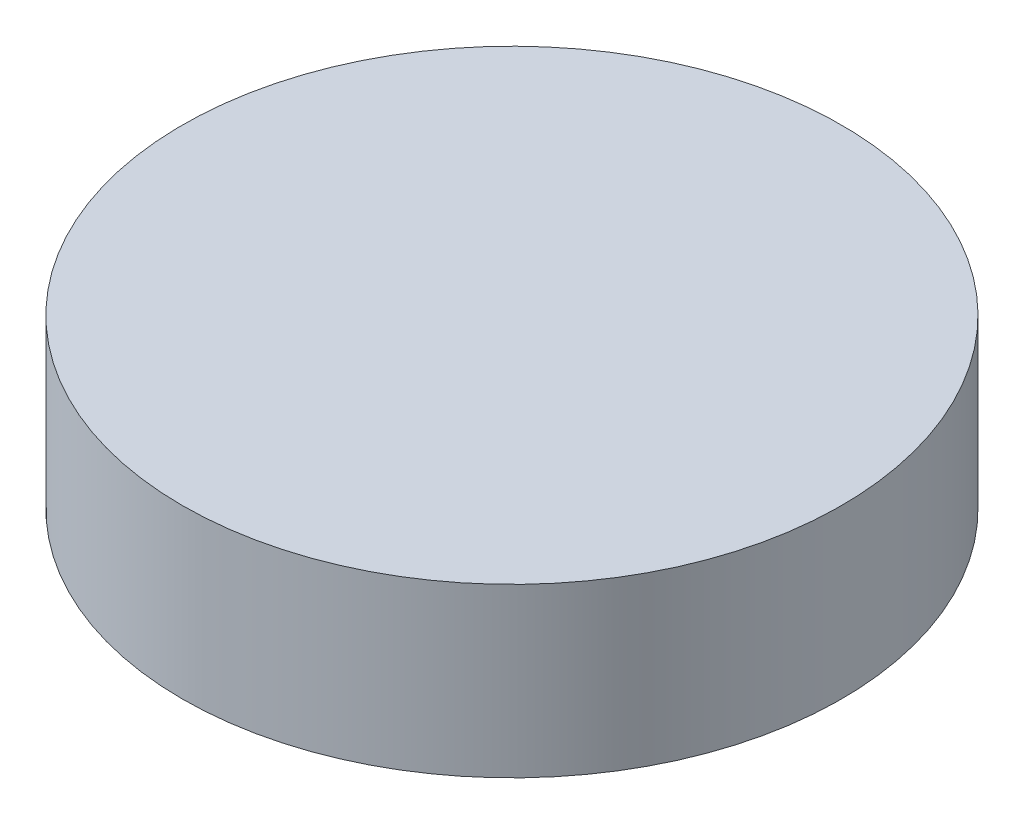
ISO-10303-21;
HEADER;
FILE_DESCRIPTION(('STEP AP214'),'2;1');
FILE_NAME('part.step','',(''),(''),'','','');
FILE_SCHEMA(('AUTOMOTIVE_DESIGN { 1 0 10303 214 1 1 1 1 }'));
ENDSEC;
DATA;
#1=APPLICATION_CONTEXT('core data for automotive mechanical design processes');
#2=APPLICATION_PROTOCOL_DEFINITION('international standard','automotive_design',2000,#1);
#3=PRODUCT_CONTEXT('',#1,'mechanical');
#4=PRODUCT('Part','Part','',(#3));
#5=PRODUCT_RELATED_PRODUCT_CATEGORY('part','',(#4));
#6=PRODUCT_DEFINITION_FORMATION('','',#4);
#7=PRODUCT_DEFINITION_CONTEXT('part definition',#1,'design');
#8=PRODUCT_DEFINITION('design','',#6,#7);
#9=PRODUCT_DEFINITION_SHAPE('','',#8);
#10=(LENGTH_UNIT() NAMED_UNIT(*) SI_UNIT(.MILLI.,.METRE.));
#11=(NAMED_UNIT(*) PLANE_ANGLE_UNIT() SI_UNIT($,.RADIAN.));
#12=(NAMED_UNIT(*) SI_UNIT($,.STERADIAN.) SOLID_ANGLE_UNIT());
#13=UNCERTAINTY_MEASURE_WITH_UNIT(LENGTH_MEASURE(1.E-05),#10,'distance_accuracy_value','');
#14=(GEOMETRIC_REPRESENTATION_CONTEXT(3) GLOBAL_UNCERTAINTY_ASSIGNED_CONTEXT((#13)) GLOBAL_UNIT_ASSIGNED_CONTEXT((#10,
#11,#12)) REPRESENTATION_CONTEXT('',''));
#15=CARTESIAN_POINT('',(0.,0.,0.));
#16=DIRECTION('',(0.,0.,1.));
#17=DIRECTION('',(1.,0.,0.));
#18=AXIS2_PLACEMENT_3D('',#15,#16,#17);
#19=CARTESIAN_POINT('',(0.,15.,0.));
#20=DIRECTION('',(0.,-1.,0.));
#21=DIRECTION('',(0.,0.,-1.));
#22=AXIS2_PLACEMENT_3D('',#19,#20,#21);
#23=CYLINDRICAL_SURFACE('',#22,29.5);
#24=CARTESIAN_POINT('',(0.,15.,0.));
#25=DIRECTION('',(0.,1.,0.));
#26=DIRECTION('',(0.,0.,1.));
#27=AXIS2_PLACEMENT_3D('',#24,#25,#26);
#28=CIRCLE('',#27,29.5);
#29=CARTESIAN_POINT('',(0.,15.,29.5));
#30=VERTEX_POINT('',#29);
#31=EDGE_CURVE('E10',#30,#30,#28,.T.);
#32=ORIENTED_EDGE('',*,*,#31,.F.);
#33=EDGE_LOOP('',(#32));
#34=FACE_BOUND('',#33,.T.);
#35=CARTESIAN_POINT('',(0.,0.,0.));
#36=DIRECTION('',(0.,1.,0.));
#37=DIRECTION('',(0.,0.,1.));
#38=AXIS2_PLACEMENT_3D('',#35,#36,#37);
#39=CIRCLE('',#38,29.5);
#40=CARTESIAN_POINT('',(0.,0.,29.5));
#41=VERTEX_POINT('',#40);
#42=EDGE_CURVE('E34',#41,#41,#39,.T.);
#43=ORIENTED_EDGE('',*,*,#42,.T.);
#44=EDGE_LOOP('',(#43));
#45=FACE_BOUND('',#44,.T.);
#46=ADVANCED_FACE('F31',(#34,#45),#23,.T.);
#47=CARTESIAN_POINT('',(0.,15.,0.));
#48=DIRECTION('',(0.,1.,0.));
#49=DIRECTION('',(0.,0.,1.));
#50=AXIS2_PLACEMENT_3D('',#47,#48,#49);
#51=PLANE('',#50);
#52=ORIENTED_EDGE('',*,*,#31,.T.);
#53=EDGE_LOOP('',(#52));
#54=FACE_BOUND('',#53,.T.);
#55=ADVANCED_FACE('F46',(#54),#51,.T.);
#56=CARTESIAN_POINT('',(0.,0.,0.));
#57=DIRECTION('',(0.,1.,0.));
#58=DIRECTION('',(0.,0.,1.));
#59=AXIS2_PLACEMENT_3D('',#56,#57,#58);
#60=PLANE('',#59);
#61=ORIENTED_EDGE('',*,*,#42,.F.);
#62=EDGE_LOOP('',(#61));
#63=FACE_BOUND('',#62,.T.);
#64=ADVANCED_FACE('F44',(#63),#60,.F.);
#65=CLOSED_SHELL('',(#46,#55,#64));
#66=MANIFOLD_SOLID_BREP('B2',#65);
#67=ADVANCED_BREP_SHAPE_REPRESENTATION('',(#18,#66),#14);
#68=SHAPE_DEFINITION_REPRESENTATION(#9,#67);
ENDSEC;
END-ISO-10303-21;
